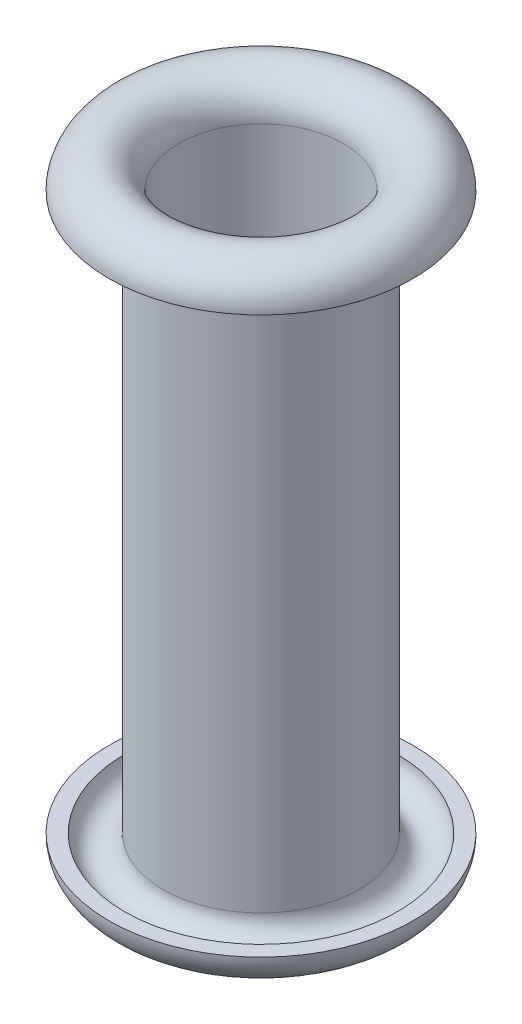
from build123d import *


with BuildPart() as part:
    # Sketch1 → Revolve1 (revolve)
    with BuildSketch(Plane.XY, mode=Mode.PRIVATE) as revolve1_sk:
        with BuildLine():
            Line((1.3335, 1.866082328), (1.3335, 10.883082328))
            ThreePointArc((1.3335, 10.883082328), (1.899043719, 11.448626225), (2.464587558, 10.883082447))
            Line((2.464587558, 10.883082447), (2.210587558, 10.883082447))
            ThreePointArc((2.210587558, 10.883082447), (1.899043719, 11.194626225), (1.5875, 10.883082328))
            Line((1.5875, 10.883082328), (1.5875, 1.866082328))
            ThreePointArc((1.5875, 1.866082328), (1.899043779, 1.554538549), (2.210587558, 1.866082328))
            Line((2.210587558, 1.866082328), (2.464587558, 1.866082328))
            ThreePointArc((2.464587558, 1.866082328), (1.899043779, 1.300538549), (1.3335, 1.866082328))
        make_face()
    revolve(revolve1_sk.sketch.rotate(Axis((0, 0, 0), (0, 1, 0)), 90), axis=Axis((0, 0, 0), (0, 1, 0)))


solid = part.part
